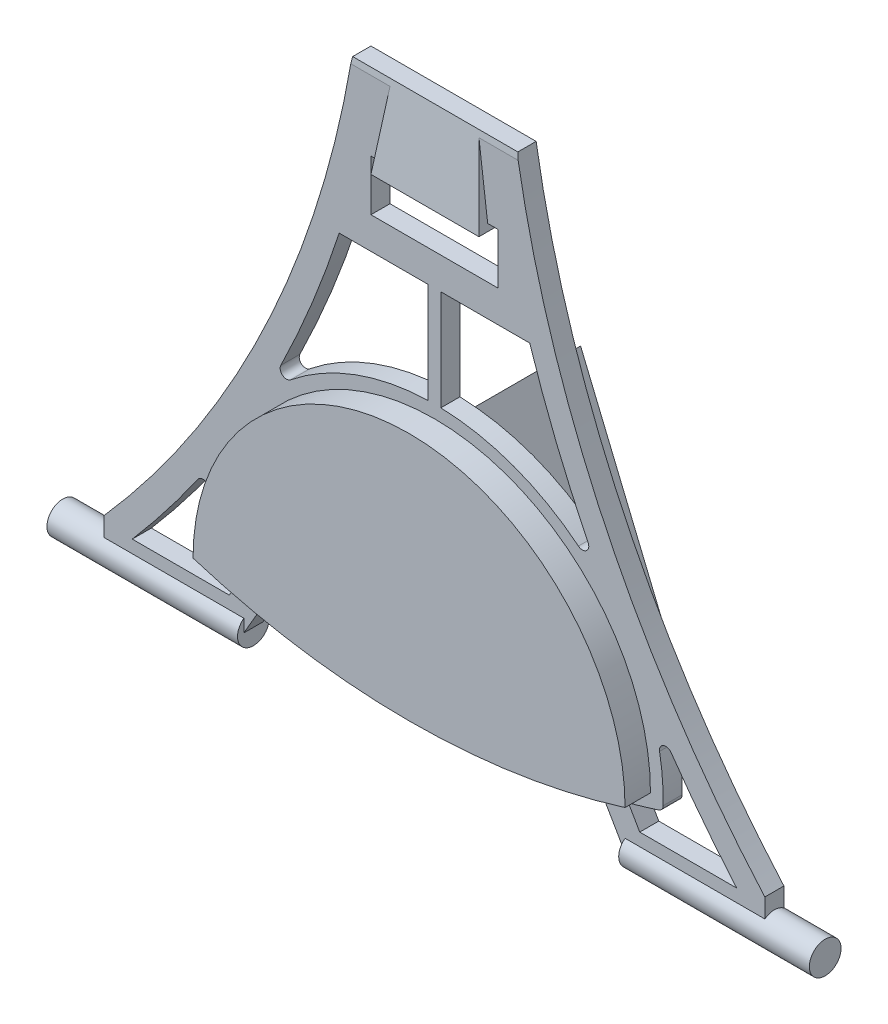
from build123d import *

# Parameters (mm, degrees)
PLAQUE_DE_BASE_DEPTH  = 1.5
ESQUISSE2_W           = 30
ESQUISSE2_H           = 2.5
BOUTON_START          = 4
BOUTON_DEPTH          = 4
CREUX_BOUTON_DEPTH    = 5
EVIDEMENT_BAS_DEPTH   = 106.75916036
EVIDEMENT_HAUT_DEPTH  = 106.75916036
ESQUISSE7_W           = 20
ESQUISSE7_H           = 8
EVIDEMENT_CLIP_DEPTH  = 106.75916036
EXTRUSION1_DEPTH      = 4.5
D_FLECTEUR_REACH      = 111.078
ESQUISSE10_W          = 1
ESQUISSE10_H          = 5
GUIDE_RESSORT_1_DEPTH = 12
ESQUISSE11_W          = 5
ESQUISSE11_H          = 1
GUIDE_RESSORT_2_DEPTH = 12


with BuildPart() as part:
    # Esquisse1 → Plaque de base (new, symmetric)
    with BuildSketch(Plane.XY):
        with BuildLine():
            Line((30, 0), (52, 0))
            Line((52, 0), (52, 5))
            ThreePointArc((52, 5), (26.748259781, 43.264416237), (13, 87))
            Line((13, 87), (-13, 87))
            ThreePointArc((-13, 87), (-26.748259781, 43.264416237), (-52, 5))
            Line((-52, 5), (-52, 0))
            Line((-52, 0), (-30, 0))
            Line((-30, 0), (-25.451899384, 7.877541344))
            ThreePointArc((-25.451899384, 7.877541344), (0, 5), (25.451899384, 7.877541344))
            Line((25.451899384, 7.877541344), (30, 0))
        make_face()
    extrude(amount=PLAQUE_DE_BASE_DEPTH, both=True)

    # Esquisse2 → Axe (revolve)
    with BuildSketch(Plane.XY, mode=Mode.PRIVATE) as axe_sk:
        with Locations((45, 1.25)):
            Rectangle(ESQUISSE2_W, ESQUISSE2_H)
    axe = revolve(axe_sk.sketch.rotate(Axis((30, 0, 0), (1, 0, 0)), 180), axis=Axis((30, 0, 0), (1, 0, 0)))

    # Sym_trie axe: Axe across plane
    add(axe.mirror(Plane(origin=(0, 0, 0), x_dir=(0, 0, 1), z_dir=(1, 0, 0))))

    # Esquisse3 → Bouton (add)
    with BuildSketch(Plane.XY.offset(1.5).offset(BOUTON_START)):
        with BuildLine():
            ThreePointArc((-34, 10.18823593), (0, 5), (34, 10.18823593))
            ThreePointArc((34, 10.18823593), (0, 44.18823593), (-34, 10.18823593))
        make_face()
    extrude(amount=-BOUTON_DEPTH)

    # Esquisse4 → Creux bouton (cut)
    with BuildSketch(Plane(origin=(0, 0, -1.5), x_dir=(-1, 0, 0), z_dir=(0, 0, -1))):
        with BuildLine():
            ThreePointArc((30.999651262, 10.335278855), (0, 41.18823593), (-30.999651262, 10.335278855))
            ThreePointArc((-30.999651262, 10.335278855), (0, 6), (30.999651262, 10.335278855))
        make_face()
    extrude(amount=-CREUX_BOUTON_DEPTH, mode=Mode.SUBTRACT)

    # Esquisse5 → Evidement bas (cut, through all)
    with BuildSketch(Plane.XY.offset(1.5)):
        with BuildLine():
            Line((47.567462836, 4), (32.309401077, 4))
            Line((32.309401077, 4), (30.526174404, 7.088639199))
            ThreePointArc((30.526174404, 7.088639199), (32.918935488, 7.768962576), (35.296557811, 8.500438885))
            ThreePointArc((35.296557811, 8.500438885), (35.793589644, 8.854775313), (35.992056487, 9.432015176))
            ThreePointArc((35.992056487, 9.432015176), (35.888967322, 13.013483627), (35.430379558, 16.566966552))
            ThreePointArc((35.430379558, 16.566966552), (36.030608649, 17.667508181), (37.234199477, 17.31702857))
            ThreePointArc((37.234199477, 17.31702857), (42.234699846, 10.529605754), (47.567462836, 4))
        make_face()
    evidement_bas = extrude(amount=-EVIDEMENT_BAS_DEPTH, mode=Mode.SUBTRACT)

    # Esquisse6 → Evidement haut (cut, through all)
    with BuildSketch(Plane.XY.offset(1.5)):
        with BuildLine():
            Line((1, 46.174344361), (1, 62))
            Line((1, 62), (14.99574008, 62))
            ThreePointArc((14.99574008, 62), (19.180818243, 50.525555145), (24.183697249, 39.383339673))
            ThreePointArc((24.183697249, 39.383339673), (23.911033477, 38.159770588), (22.657458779, 38.163931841))
            ThreePointArc((22.657458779, 38.163931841), (12.488415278, 43.952706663), (1, 46.174344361))
        make_face()
    evidement_haut = extrude(amount=-EVIDEMENT_HAUT_DEPTH, mode=Mode.SUBTRACT)

    # Sym_trie1: Evidement bas, Evidement haut across plane
    add(evidement_bas.mirror(Plane(origin=(0, 0, 0), x_dir=(0, 0, 1), z_dir=(1, 0, 0))), mode=Mode.SUBTRACT)
    add(evidement_haut.mirror(Plane(origin=(0, 0, 0), x_dir=(0, 0, 1), z_dir=(1, 0, 0))), mode=Mode.SUBTRACT)

    # Esquisse7 → Evidement clip (cut, through all)
    with BuildSketch(Plane.XY.offset(1.5)):
        with Locations((0, 71)):
            Rectangle(ESQUISSE7_W, ESQUISSE7_H)
    extrude(amount=-EVIDEMENT_CLIP_DEPTH, mode=Mode.SUBTRACT)

    # Esquisse8 → Extrusion1 (add)
    with BuildSketch(Plane(origin=(0, 0, -1.5), x_dir=(-1, 0, 0), z_dir=(0, 0, -1))):
        Polygon((-7, 86), (7, 86), (8.5, 74), (-8.5, 74), align=None)
    extrude(amount=-EXTRUSION1_DEPTH)

    # Enl_v. mat.-Surface1
    split(bisect_by=Plane(origin=(0, 1.507692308, 12.061538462), x_dir=(-1, 0, 0), z_dir=(0, -0.12403473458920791, -0.9922778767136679)), keep=Keep.TOP)

    # D_flecteur: up to this face of the body (flat: up to its plane)
    d_flecteur_end = Plane(part.part.faces().sort_by_distance((0, 21.837286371, 3.5))[0])
    # Esquisse9 → D_flecteur (add, up to the picked face)
    with BuildSketch(Plane(origin=(0, 0, -21.5), x_dir=(-1, 0, 0), z_dir=(0, 0, -1)), mode=Mode.PRIVATE) as d_flecteur_sk1:
        Polygon((-14.133184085, 5.879475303), (0, 40), (14.133184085, 5.879475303), (15.057063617, 6.262158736), (0, 42.61312593), (-15.057063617, 6.262158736), align=None)
    d_flecteur_tool1 = split(extrude(d_flecteur_sk1.sketch, amount=-D_FLECTEUR_REACH, mode=Mode.PRIVATE), bisect_by=d_flecteur_end, keep=Keep.BOTH, mode=Mode.PRIVATE)
    add(d_flecteur_tool1.solids().sort_by(Axis((7.505432, 23.121511, -21.5), (0, 0, 1)))[0])

    # Esquisse10 → Guide ressort 1 (add)
    with BuildSketch(Plane(origin=(0, 0, 3.5), x_dir=(-1, 0, 0), z_dir=(0, 0, -1))):
        with Locations((0, 11)):
            Rectangle(ESQUISSE10_W, ESQUISSE10_H)
    extrude(amount=GUIDE_RESSORT_1_DEPTH)

    # Esquisse11 → Guide ressort 2 (add)
    with BuildSketch(Plane(origin=(0, 0, 3.5), x_dir=(-1, 0, 0), z_dir=(0, 0, -1))):
        with Locations((0, 11)):
            Rectangle(ESQUISSE11_W, ESQUISSE11_H)
    extrude(amount=GUIDE_RESSORT_2_DEPTH)


solid = part.part
